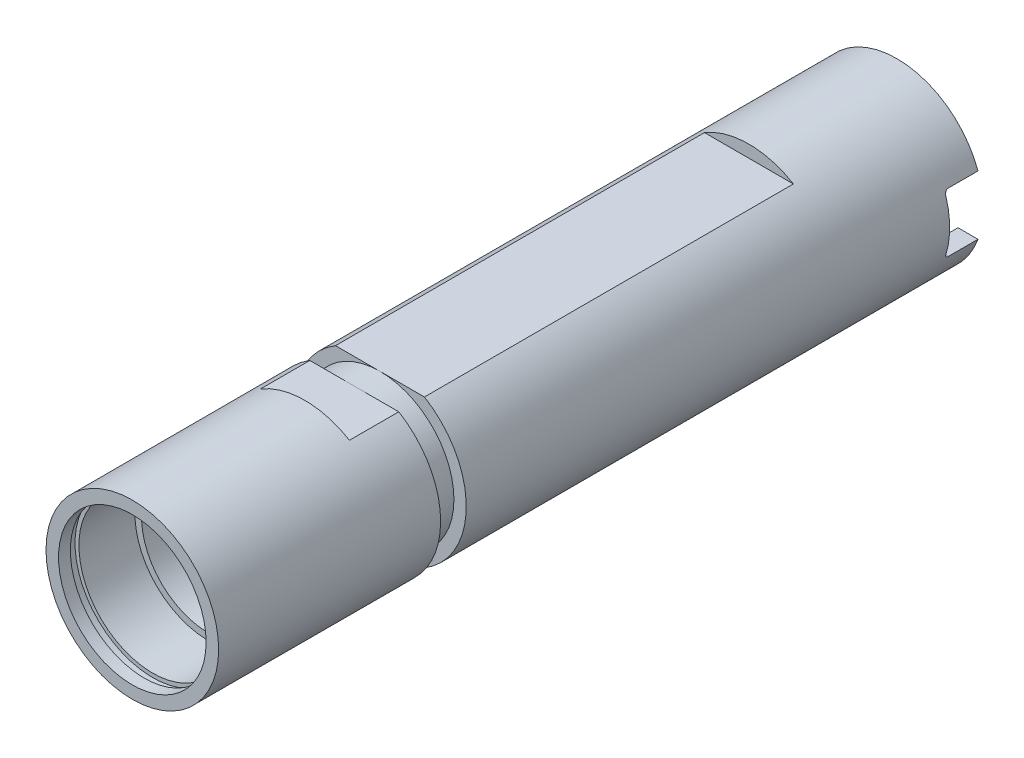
from build123d import *

# Parameters (mm, degrees)
CUT_EXTRUDE1_REACH      = 85.739
SKETCH3_R               = 1
CUT_EXTRUDE2_DEPTH      = 100.671740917
CUT_EXTRUDE2_DEPTH_BACK = 100.671740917
SKETCH8_W               = 1.5875
SKETCH8_H               = 57.15
SKETCH10_W              = 4.318
SKETCH10_H              = 7.62
CUT_EXTRUDE3_DEPTH      = 100.671740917
FILLET1_R               = 0.508


with BuildPart() as part:
    # Sketch2 → Revolve1 (revolve)
    with BuildSketch(Plane(origin=(0, 0, 0), x_dir=(0, 0, -1), z_dir=(1, 0, 0)), mode=Mode.PRIVATE) as revolve1_sk:
        Polygon((0, 11.1125), (0, 9.5), (1.524, 9.5), (1.524, 10), (2.624, 10), (2.624, 9.5), (9.824, 9.5), (9.824, 8.636), (16.174, 8.636), (16.174, 5.0038), (19.349, 5.0038), (19.349, 8.255), (91.49311228, 8.255), (92.329, 8.7376), (94.107, 8.7376), (94.107, 9.5631), (95.885, 9.5631), (95.885, 8.7376), (98.425, 8.7376), (98.425, 11.1125), (31.877, 11.1125), (31.877, 9.525), (28.575, 9.525), (28.575, 11.1125), align=None)
    revolve(revolve1_sk.sketch.rotate(Axis((0, 0, 67.438073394), (0, 0, -1)), 90), axis=Axis((0, 0, 67.438073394), (0, 0, -1)))

    # Sketch3 → Cut-Extrude1 (cut, up to next)
    with BuildSketch(Plane.XY.offset(-16.174), mode=Mode.PRIVATE) as cut_extrude1_sk1:
        with Locations((0, 6.5)):
            Circle(SKETCH3_R)
    cut_extrude1_tool1 = extrude(cut_extrude1_sk1.sketch, amount=-CUT_EXTRUDE1_REACH, mode=Mode.PRIVATE) & part.part
    # Sketch3 → Cut-Extrude1 (cut, up to next)
    with BuildSketch(Plane.XY.offset(-16.174), mode=Mode.PRIVATE) as cut_extrude1_sk2:
        with Locations((5.629165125, 3.25)):
            Circle(SKETCH3_R)
    cut_extrude1_tool2 = extrude(cut_extrude1_sk2.sketch, amount=-CUT_EXTRUDE1_REACH, mode=Mode.PRIVATE) & part.part
    # Sketch3 → Cut-Extrude1 (cut, up to next)
    with BuildSketch(Plane.XY.offset(-16.174), mode=Mode.PRIVATE) as cut_extrude1_sk3:
        with Locations((5.629165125, -3.25)):
            Circle(SKETCH3_R)
    cut_extrude1_tool3 = extrude(cut_extrude1_sk3.sketch, amount=-CUT_EXTRUDE1_REACH, mode=Mode.PRIVATE) & part.part
    # Sketch3 → Cut-Extrude1 (cut, up to next)
    with BuildSketch(Plane.XY.offset(-16.174), mode=Mode.PRIVATE) as cut_extrude1_sk4:
        with Locations((0, -6.5)):
            Circle(SKETCH3_R)
    cut_extrude1_tool4 = extrude(cut_extrude1_sk4.sketch, amount=-CUT_EXTRUDE1_REACH, mode=Mode.PRIVATE) & part.part
    # Sketch3 → Cut-Extrude1 (cut, up to next)
    with BuildSketch(Plane.XY.offset(-16.174), mode=Mode.PRIVATE) as cut_extrude1_sk5:
        with Locations((-5.629165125, -3.25)):
            Circle(SKETCH3_R)
    cut_extrude1_tool5 = extrude(cut_extrude1_sk5.sketch, amount=-CUT_EXTRUDE1_REACH, mode=Mode.PRIVATE) & part.part
    # Sketch3 → Cut-Extrude1 (cut, up to next)
    with BuildSketch(Plane.XY.offset(-16.174), mode=Mode.PRIVATE) as cut_extrude1_sk6:
        with Locations((-5.629165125, 3.25)):
            Circle(SKETCH3_R)
    cut_extrude1_tool6 = extrude(cut_extrude1_sk6.sketch, amount=-CUT_EXTRUDE1_REACH, mode=Mode.PRIVATE) & part.part
    add(cut_extrude1_tool1.solids().sort_by_distance((0, 6.5, -16.174))[0], mode=Mode.SUBTRACT)
    add(cut_extrude1_tool2.solids().sort_by_distance((5.629165, 3.25, -16.174))[0], mode=Mode.SUBTRACT)
    add(cut_extrude1_tool3.solids().sort_by_distance((5.629165, -3.25, -16.174))[0], mode=Mode.SUBTRACT)
    add(cut_extrude1_tool4.solids().sort_by_distance((0, -6.5, -16.174))[0], mode=Mode.SUBTRACT)
    add(cut_extrude1_tool5.solids().sort_by_distance((-5.629165, -3.25, -16.174))[0], mode=Mode.SUBTRACT)
    add(cut_extrude1_tool6.solids().sort_by_distance((-5.629165, 3.25, -16.174))[0], mode=Mode.SUBTRACT)

    # Sketch8 → Cut-Extrude2 (cut, two sides: drawn at the far end of the back side and taken through both)
    with BuildSketch(Plane(origin=(0, 0, 0), x_dir=(0, -1, 0), z_dir=(1, 0, 0)).offset(-CUT_EXTRUDE2_DEPTH_BACK)):
        with Locations((-10.31875, 50.8)):
            Rectangle(SKETCH8_W, SKETCH8_H)
        with Locations((10.31875, 50.8)):
            Rectangle(SKETCH8_W, SKETCH8_H)
    extrude(amount=CUT_EXTRUDE2_DEPTH + CUT_EXTRUDE2_DEPTH_BACK, mode=Mode.SUBTRACT)

    # Sketch10 → Cut-Extrude3 (cut, through all)
    with BuildSketch(Plane(origin=(0, 0, 0), x_dir=(0, 0, -1), z_dir=(1, 0, 0))):
        with Locations((96.266, 0)):
            Rectangle(SKETCH10_W, SKETCH10_H)
    extrude(amount=CUT_EXTRUDE3_DEPTH, mode=Mode.SUBTRACT)

    # Fillet1
    fillet1_edges = [part.edges().sort_by_distance(p)[0] for p in [
        (9.605152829, 3.81, -94.107),
        (9.605152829, -3.81, -94.107),
    ]]
    fillet(fillet1_edges, radius=FILLET1_R)


solid = part.part
